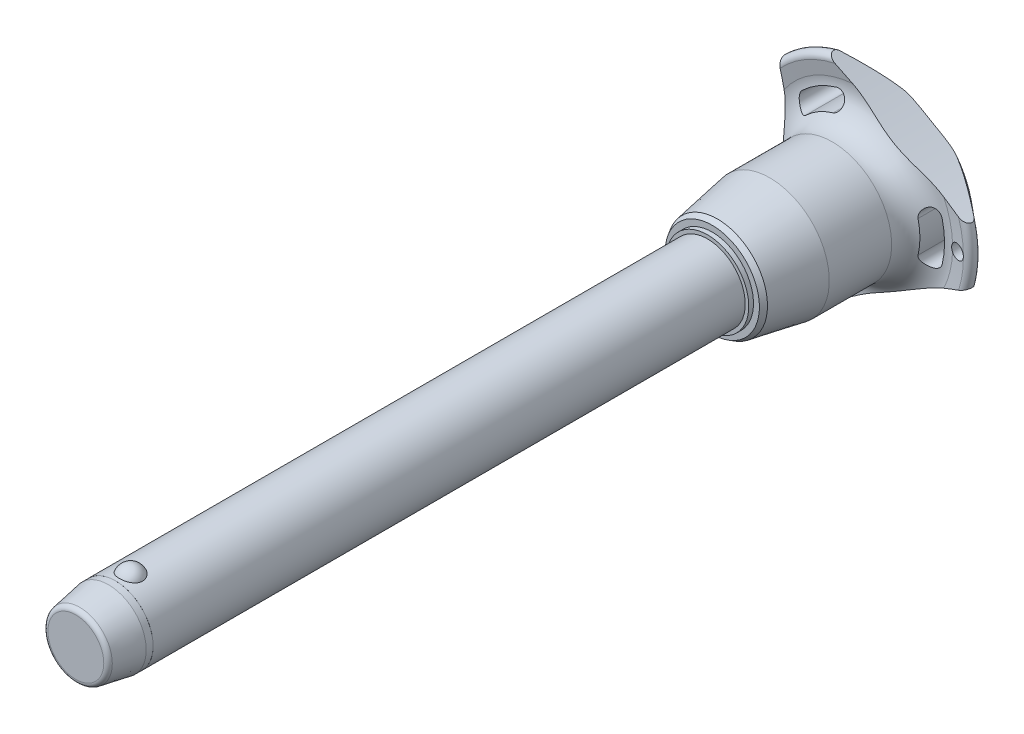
from build123d import *

# Parameters (mm, degrees)
SKETCH1_R           = 8
BOSS_EXTRUDE1_DEPTH = 120
SKETCH2_R           = 7
BOSS_EXTRUDE2_DEPTH = 39.7
BOSS_EXTRUDE3_START = 14
SKETCH1_2_R         = 8
BOSS_EXTRUDE3_DEPTH = 14
CHAMFER1_SIZE       = 7
CHAMFER1_SIZE2      = 1.234288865
FILLET1_R           = 1
SKETCH6_R           = 144.275
CUT_EXTRUDE1_DEPTH  = 164.211281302
CIRPATTERN1_COUNT   = 3
SKETCH7_R           = 1.5
CUT_EXTRUDE2_DEPTH  = 164.08827178
SKETCH8_R           = 8
SKETCH8_R_2         = 7.99
CUT_EXTRUDE3_DEPTH  = 8.4


with BuildPart() as part:
    # Sketch1 → Boss-Extrude1 (new body)
    with BuildSketch(Plane.XY):
        Circle(SKETCH1_R)
    extrude(amount=-BOSS_EXTRUDE1_DEPTH)

    # Sketch2 → Boss-Extrude2 (add)
    with BuildSketch(Plane(origin=(0, 0, -120), x_dir=(-1, 0, 0), z_dir=(0, 0, -1))):
        Circle(SKETCH2_R)
    extrude(amount=BOSS_EXTRUDE2_DEPTH)

    # Sketch3 → Revolve1 (revolve)
    with BuildSketch(Plane(origin=(0, 0, 0), x_dir=(0, 0, -1), z_dir=(1, 0, 0))):
        with BuildLine():
            Line((-2.387467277, 9.5), (-2.387467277, 4.2))
            ThreePointArc((-2.387467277, 4.2), (0.262532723, 6.85), (-2.387467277, 9.5))
        make_face()
        with BuildLine():
            Line((-2.387467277, -4.2), (-2.387467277, -9.5))
            ThreePointArc((-2.387467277, -9.5), (0.262532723, -6.85), (-2.387467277, -4.2))
        make_face()
    revolve(axis=Axis((0, -4.2, 2.387467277), (0, 1, 0)))

    # Sketch1_2 → Boss-Extrude3 (add)
    with BuildSketch(Plane.XY.offset(BOSS_EXTRUDE3_START)):
        Circle(SKETCH1_2_R)
    extrude(amount=-BOSS_EXTRUDE3_DEPTH)

    # Chamfer1
    chamfer1_edges = [part.edges().sort_by_distance(p)[0] for p in [
        (-8, 0, 14),
    ]]
    chamfer1_side = [part.faces().sort_by_distance(p)[0] for p in [
        (-8, 0, -53),
    ]]
    chamfer(chamfer1_edges, length=CHAMFER1_SIZE, length2=CHAMFER1_SIZE2, reference=chamfer1_side[0])

    # Fillet1
    fillet1_edges = [part.edges().sort_by_distance(p)[0] for p in [
        (-6.765711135, 0, 14),
        (7, 0, -159.7),
    ]]
    fillet(fillet1_edges, radius=FILLET1_R)

    # Sketch4 → Revolve2 (revolve)
    with BuildSketch(Plane(origin=(0, 0, 0), x_dir=(0, 0, -1), z_dir=(1, 0, 0)), mode=Mode.PRIVATE) as revolve2_sk:
        Polygon((120, 0), (120, 8.754868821), (121, 8.754868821), (121, 10.007796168), (122.085066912, 10.634259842), (133.233333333, 12.6), (146.466666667, 12.6), (146.466666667, 0), align=None)
    revolve(revolve2_sk.sketch.rotate(Axis((0, 0, -146.466666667), (0, 0, 1)), 90), axis=Axis((0, 0, -146.466666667), (0, 0, 1)))

    # Sketch5 → Revolve3 (revolve)
    with BuildSketch(Plane(origin=(0, 0, 0), x_dir=(0, 0, -1), z_dir=(1, 0, 0)), mode=Mode.PRIVATE) as revolve3_sk:
        with BuildLine():
            Line((152.379459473, 19.619255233), (151.900774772, 22.396148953))
            ThreePointArc((151.900774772, 22.396148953), (152.578274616, 23.688538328), (154.002586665, 23.371345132))
            Line((154.002586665, 23.371345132), (159.141488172, 17.247040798))
            ThreePointArc((159.141488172, 17.247040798), (159.7, 15.584758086), (158.978803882, 13.986322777))
            ThreePointArc((158.978803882, 13.986322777), (154.617427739, 7.589034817), (153.083333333, 0))
            Line((153.083333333, 0), (146.466666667, 0))
            Line((146.466666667, 0), (146.466666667, 12.6))
            ThreePointArc((146.466666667, 12.6), (151.055540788, 14.734481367), (152.379459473, 19.619255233))
        make_face()
    revolve(revolve3_sk.sketch.rotate(Axis((0, 0, -153.083333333), (0, 0, 1)), 90), axis=Axis((0, 0, -153.083333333), (0, 0, 1)))

    # Sketch6 → Cut-Extrude1 (cut, through all)
    with BuildSketch(Plane.XY):
        with Locations((-159.975, 0)):
            Circle(SKETCH6_R)
        with BuildLine():
            ThreePointArc((17.365443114, -4.192809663), (17.864441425, 0), (17.365443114, 4.192809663))
            ThreePointArc((17.365443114, 4.192809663), (15.247788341, 5.486749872), (13.953848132, 3.369095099))
            ThreePointArc((13.953848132, 3.369095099), (14.354813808, 0), (13.953848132, -3.369095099))
            ThreePointArc((13.953848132, -3.369095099), (15.247788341, -5.486749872), (17.365443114, -4.192809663))
        make_face()
    cut_extrude1 = extrude(amount=-CUT_EXTRUDE1_DEPTH, mode=Mode.SUBTRACT)

    # CirPattern1: Cut-Extrude1 ×3 about axis
    cirpattern1_axis = Axis((0, 0, 0), (0, 0, 1))
    for i in range(1, CIRPATTERN1_COUNT):
        add(cut_extrude1.rotate(cirpattern1_axis, i * 360 / CIRPATTERN1_COUNT), mode=Mode.SUBTRACT)

    # Sketch7 → Cut-Extrude2 (cut, through all)
    with BuildSketch(Plane.XY):
        with Locations(Location((20.864441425, 0, 0), (0, 0, 221.008319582))):
            Circle(SKETCH7_R)
    extrude(amount=-CUT_EXTRUDE2_DEPTH, mode=Mode.SUBTRACT)

    # Sketch8 → Cut-Extrude3 (cut)
    with BuildSketch(Plane.XY.offset(14)):
        Circle(SKETCH8_R)
        Circle(SKETCH8_R_2, mode=Mode.SUBTRACT)
    extrude(amount=-CUT_EXTRUDE3_DEPTH, mode=Mode.SUBTRACT)


solid = part.part
